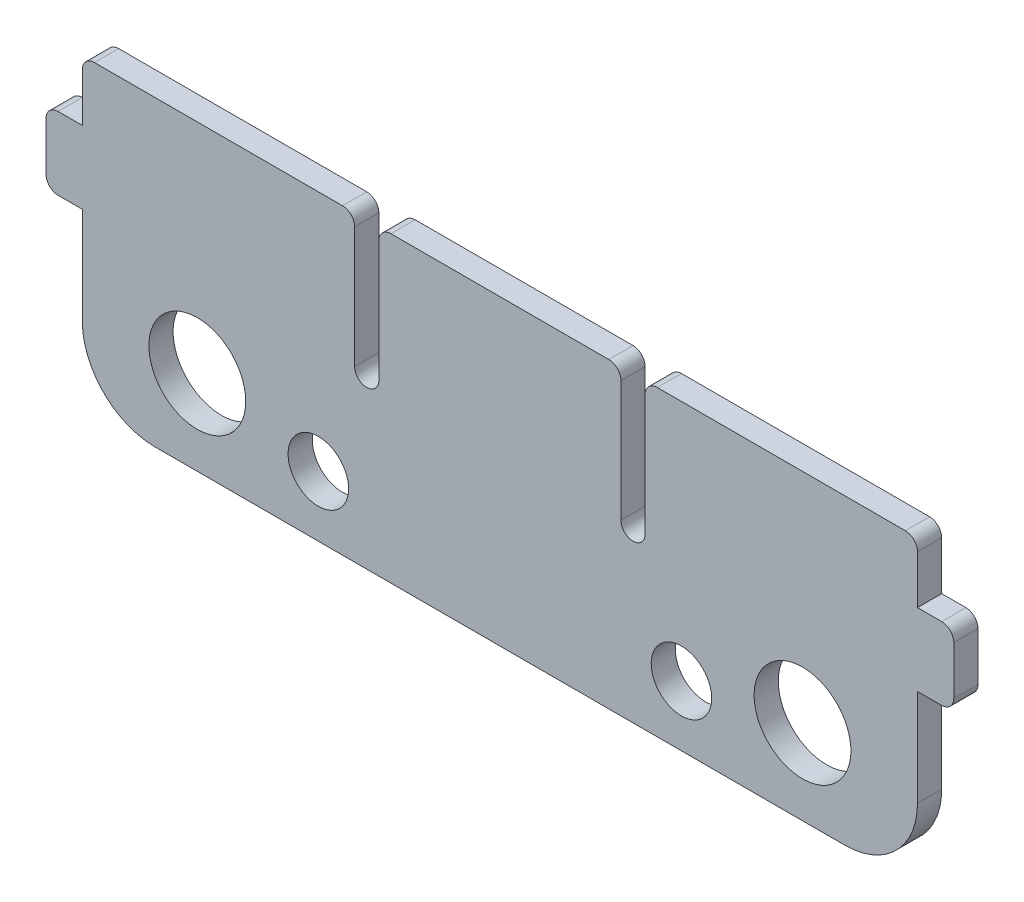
ISO-10303-21;
HEADER;
FILE_DESCRIPTION(('STEP AP214'),'2;1');
FILE_NAME('part.step','',(''),(''),'','','');
FILE_SCHEMA(('AUTOMOTIVE_DESIGN { 1 0 10303 214 1 1 1 1 }'));
ENDSEC;
DATA;
#1=APPLICATION_CONTEXT('core data for automotive mechanical design processes');
#2=APPLICATION_PROTOCOL_DEFINITION('international standard','automotive_design',2000,#1);
#3=PRODUCT_CONTEXT('',#1,'mechanical');
#4=PRODUCT('Part','Part','',(#3));
#5=PRODUCT_RELATED_PRODUCT_CATEGORY('part','',(#4));
#6=PRODUCT_DEFINITION_FORMATION('','',#4);
#7=PRODUCT_DEFINITION_CONTEXT('part definition',#1,'design');
#8=PRODUCT_DEFINITION('design','',#6,#7);
#9=PRODUCT_DEFINITION_SHAPE('','',#8);
#10=(LENGTH_UNIT() NAMED_UNIT(*) SI_UNIT(.MILLI.,.METRE.));
#11=(NAMED_UNIT(*) PLANE_ANGLE_UNIT() SI_UNIT($,.RADIAN.));
#12=(NAMED_UNIT(*) SI_UNIT($,.STERADIAN.) SOLID_ANGLE_UNIT());
#13=UNCERTAINTY_MEASURE_WITH_UNIT(LENGTH_MEASURE(1.E-05),#10,'distance_accuracy_value','');
#14=(GEOMETRIC_REPRESENTATION_CONTEXT(3) GLOBAL_UNCERTAINTY_ASSIGNED_CONTEXT((#13)) GLOBAL_UNIT_ASSIGNED_CONTEXT((#10,
#11,#12)) REPRESENTATION_CONTEXT('',''));
#15=CARTESIAN_POINT('',(0.,0.,0.));
#16=DIRECTION('',(0.,0.,1.));
#17=DIRECTION('',(1.,0.,0.));
#18=AXIS2_PLACEMENT_3D('',#15,#16,#17);
#19=CARTESIAN_POINT('',(28.5,-6.5,2.));
#20=DIRECTION('',(0.,0.,1.));
#21=DIRECTION('',(1.,0.,0.));
#22=AXIS2_PLACEMENT_3D('',#19,#20,#21);
#23=PLANE('',#22);
#24=CARTESIAN_POINT('',(15.,-7.5,2.));
#25=DIRECTION('',(0.,0.,1.));
#26=DIRECTION('',(-1.,0.,0.));
#27=AXIS2_PLACEMENT_3D('',#24,#25,#26);
#28=CIRCLE('',#27,2.5);
#29=CARTESIAN_POINT('',(12.5,-7.5,2.));
#30=VERTEX_POINT('',#29);
#31=EDGE_CURVE('E551',#30,#30,#28,.T.);
#32=ORIENTED_EDGE('',*,*,#31,.F.);
#33=EDGE_LOOP('',(#32));
#34=FACE_BOUND('',#33,.T.);
#35=CARTESIAN_POINT('',(-25.,-5.5,2.));
#36=DIRECTION('',(0.,0.,1.));
#37=DIRECTION('',(1.,0.,0.));
#38=AXIS2_PLACEMENT_3D('',#35,#36,#37);
#39=CIRCLE('',#38,4.);
#40=CARTESIAN_POINT('',(-21.,-5.5,2.));
#41=VERTEX_POINT('',#40);
#42=EDGE_CURVE('E277',#41,#41,#39,.T.);
#43=ORIENTED_EDGE('',*,*,#42,.F.);
#44=EDGE_LOOP('',(#43));
#45=FACE_BOUND('',#44,.T.);
#46=CARTESIAN_POINT('',(28.5,-6.5,2.));
#47=DIRECTION('',(0.,0.,1.));
#48=DIRECTION('',(1.,0.,0.));
#49=AXIS2_PLACEMENT_3D('',#46,#47,#48);
#50=CIRCLE('',#49,6.);
#51=CARTESIAN_POINT('',(28.5,-12.5,2.));
#52=VERTEX_POINT('',#51);
#53=CARTESIAN_POINT('',(34.5,-6.49999999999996,2.));
#54=VERTEX_POINT('',#53);
#55=EDGE_CURVE('E336',#52,#54,#50,.T.);
#56=ORIENTED_EDGE('',*,*,#55,.T.);
#57=DIRECTION('',(0.,1.,0.));
#58=VECTOR('',#57,1.);
#59=CARTESIAN_POINT('',(34.5,1.5,2.));
#60=LINE('',#59,#58);
#61=CARTESIAN_POINT('',(34.5,1.5,2.));
#62=VERTEX_POINT('',#61);
#63=EDGE_CURVE('E164',#54,#62,#60,.T.);
#64=ORIENTED_EDGE('',*,*,#63,.T.);
#65=DIRECTION('',(1.,0.,0.));
#66=VECTOR('',#65,1.);
#67=CARTESIAN_POINT('',(34.5,1.5,2.));
#68=LINE('',#67,#66);
#69=CARTESIAN_POINT('',(36.5,1.5,2.));
#70=VERTEX_POINT('',#69);
#71=EDGE_CURVE('E423',#62,#70,#68,.T.);
#72=ORIENTED_EDGE('',*,*,#71,.T.);
#73=CARTESIAN_POINT('',(36.5,2.5,2.));
#74=DIRECTION('',(0.,0.,1.));
#75=DIRECTION('',(1.,0.,0.));
#76=AXIS2_PLACEMENT_3D('',#73,#74,#75);
#77=CIRCLE('',#76,1.);
#78=CARTESIAN_POINT('',(37.5,2.50000000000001,2.));
#79=VERTEX_POINT('',#78);
#80=EDGE_CURVE('E442',#70,#79,#77,.T.);
#81=ORIENTED_EDGE('',*,*,#80,.T.);
#82=DIRECTION('',(0.,1.,0.));
#83=VECTOR('',#82,1.);
#84=CARTESIAN_POINT('',(37.5,6.5,2.));
#85=LINE('',#84,#83);
#86=CARTESIAN_POINT('',(37.5,6.5,2.));
#87=VERTEX_POINT('',#86);
#88=EDGE_CURVE('E439',#79,#87,#85,.T.);
#89=ORIENTED_EDGE('',*,*,#88,.T.);
#90=CARTESIAN_POINT('',(36.5,6.5,2.));
#91=DIRECTION('',(0.,0.,1.));
#92=DIRECTION('',(-1.,0.,0.));
#93=AXIS2_PLACEMENT_3D('',#90,#91,#92);
#94=CIRCLE('',#93,1.);
#95=CARTESIAN_POINT('',(36.5,7.5,2.));
#96=VERTEX_POINT('',#95);
#97=EDGE_CURVE('E441',#87,#96,#94,.T.);
#98=ORIENTED_EDGE('',*,*,#97,.T.);
#99=DIRECTION('',(-1.,0.,0.));
#100=VECTOR('',#99,1.);
#101=CARTESIAN_POINT('',(34.5,7.5,2.));
#102=LINE('',#101,#100);
#103=CARTESIAN_POINT('',(34.5,7.5,2.));
#104=VERTEX_POINT('',#103);
#105=EDGE_CURVE('E444',#96,#104,#102,.T.);
#106=ORIENTED_EDGE('',*,*,#105,.T.);
#107=DIRECTION('',(0.,1.,0.));
#108=VECTOR('',#107,1.);
#109=CARTESIAN_POINT('',(34.5,11.5,2.));
#110=LINE('',#109,#108);
#111=CARTESIAN_POINT('',(34.5,11.5,2.));
#112=VERTEX_POINT('',#111);
#113=EDGE_CURVE('E450',#104,#112,#110,.T.);
#114=ORIENTED_EDGE('',*,*,#113,.T.);
#115=CARTESIAN_POINT('',(33.5,11.5,2.));
#116=DIRECTION('',(0.,0.,1.));
#117=DIRECTION('',(-1.,0.,0.));
#118=AXIS2_PLACEMENT_3D('',#115,#116,#117);
#119=CIRCLE('',#118,1.);
#120=CARTESIAN_POINT('',(33.5,12.5,2.));
#121=VERTEX_POINT('',#120);
#122=EDGE_CURVE('E452',#112,#121,#119,.T.);
#123=ORIENTED_EDGE('',*,*,#122,.T.);
#124=DIRECTION('',(-1.,0.,0.));
#125=VECTOR('',#124,1.);
#126=CARTESIAN_POINT('',(13.,12.5,2.));
#127=LINE('',#126,#125);
#128=CARTESIAN_POINT('',(13.,12.5,2.));
#129=VERTEX_POINT('',#128);
#130=EDGE_CURVE('E454',#121,#129,#127,.T.);
#131=ORIENTED_EDGE('',*,*,#130,.T.);
#132=CARTESIAN_POINT('',(13.,11.5,2.));
#133=DIRECTION('',(0.,0.,1.));
#134=DIRECTION('',(-1.,0.,0.));
#135=AXIS2_PLACEMENT_3D('',#132,#133,#134);
#136=CIRCLE('',#135,1.);
#137=CARTESIAN_POINT('',(12.,11.5,2.));
#138=VERTEX_POINT('',#137);
#139=EDGE_CURVE('E456',#129,#138,#136,.T.);
#140=ORIENTED_EDGE('',*,*,#139,.T.);
#141=DIRECTION('',(0.,-1.,0.));
#142=VECTOR('',#141,1.);
#143=CARTESIAN_POINT('',(12.,11.5,2.));
#144=LINE('',#143,#142);
#145=CARTESIAN_POINT('',(12.,1.5,2.));
#146=VERTEX_POINT('',#145);
#147=EDGE_CURVE('E458',#138,#146,#144,.T.);
#148=ORIENTED_EDGE('',*,*,#147,.T.);
#149=CARTESIAN_POINT('',(11.,1.5,2.));
#150=DIRECTION('',(0.,0.,-1.));
#151=DIRECTION('',(1.,0.,0.));
#152=AXIS2_PLACEMENT_3D('',#149,#150,#151);
#153=CIRCLE('',#152,0.999999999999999);
#154=CARTESIAN_POINT('',(10.,1.5,2.));
#155=VERTEX_POINT('',#154);
#156=EDGE_CURVE('E460',#146,#155,#153,.T.);
#157=ORIENTED_EDGE('',*,*,#156,.T.);
#158=DIRECTION('',(0.,1.,0.));
#159=VECTOR('',#158,1.);
#160=CARTESIAN_POINT('',(10.,11.5,2.));
#161=LINE('',#160,#159);
#162=CARTESIAN_POINT('',(10.,11.5,2.));
#163=VERTEX_POINT('',#162);
#164=EDGE_CURVE('E462',#155,#163,#161,.T.);
#165=ORIENTED_EDGE('',*,*,#164,.T.);
#166=CARTESIAN_POINT('',(9.,11.5,2.));
#167=DIRECTION('',(0.,0.,1.));
#168=DIRECTION('',(1.,0.,0.));
#169=AXIS2_PLACEMENT_3D('',#166,#167,#168);
#170=CIRCLE('',#169,1.);
#171=CARTESIAN_POINT('',(8.99999999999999,12.5,2.));
#172=VERTEX_POINT('',#171);
#173=EDGE_CURVE('E464',#163,#172,#170,.T.);
#174=ORIENTED_EDGE('',*,*,#173,.T.);
#175=DIRECTION('',(-1.,0.,0.));
#176=VECTOR('',#175,1.);
#177=CARTESIAN_POINT('',(-8.99999999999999,12.5,2.));
#178=LINE('',#177,#176);
#179=CARTESIAN_POINT('',(-8.99999999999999,12.5,2.));
#180=VERTEX_POINT('',#179);
#181=EDGE_CURVE('E466',#172,#180,#178,.T.);
#182=ORIENTED_EDGE('',*,*,#181,.T.);
#183=CARTESIAN_POINT('',(-9.,11.5,2.));
#184=DIRECTION('',(0.,0.,1.));
#185=DIRECTION('',(-1.,0.,0.));
#186=AXIS2_PLACEMENT_3D('',#183,#184,#185);
#187=CIRCLE('',#186,1.);
#188=CARTESIAN_POINT('',(-10.,11.5,2.));
#189=VERTEX_POINT('',#188);
#190=EDGE_CURVE('E468',#180,#189,#187,.T.);
#191=ORIENTED_EDGE('',*,*,#190,.T.);
#192=DIRECTION('',(0.,-1.,0.));
#193=VECTOR('',#192,1.);
#194=CARTESIAN_POINT('',(-10.,11.5,2.));
#195=LINE('',#194,#193);
#196=CARTESIAN_POINT('',(-10.,1.5,2.));
#197=VERTEX_POINT('',#196);
#198=EDGE_CURVE('E470',#189,#197,#195,.T.);
#199=ORIENTED_EDGE('',*,*,#198,.T.);
#200=CARTESIAN_POINT('',(-11.,1.5,2.));
#201=DIRECTION('',(0.,0.,-1.));
#202=DIRECTION('',(1.,0.,0.));
#203=AXIS2_PLACEMENT_3D('',#200,#201,#202);
#204=CIRCLE('',#203,0.999999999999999);
#205=CARTESIAN_POINT('',(-12.,1.5,2.));
#206=VERTEX_POINT('',#205);
#207=EDGE_CURVE('E472',#197,#206,#204,.T.);
#208=ORIENTED_EDGE('',*,*,#207,.T.);
#209=DIRECTION('',(0.,1.,0.));
#210=VECTOR('',#209,1.);
#211=CARTESIAN_POINT('',(-12.,11.5,2.));
#212=LINE('',#211,#210);
#213=CARTESIAN_POINT('',(-12.,11.5,2.));
#214=VERTEX_POINT('',#213);
#215=EDGE_CURVE('E474',#206,#214,#212,.T.);
#216=ORIENTED_EDGE('',*,*,#215,.T.);
#217=CARTESIAN_POINT('',(-13.,11.5,2.));
#218=DIRECTION('',(0.,0.,1.));
#219=DIRECTION('',(1.,0.,0.));
#220=AXIS2_PLACEMENT_3D('',#217,#218,#219);
#221=CIRCLE('',#220,1.);
#222=CARTESIAN_POINT('',(-13.,12.5,2.));
#223=VERTEX_POINT('',#222);
#224=EDGE_CURVE('E476',#214,#223,#221,.T.);
#225=ORIENTED_EDGE('',*,*,#224,.T.);
#226=DIRECTION('',(-1.,0.,0.));
#227=VECTOR('',#226,1.);
#228=CARTESIAN_POINT('',(-33.5,12.5,2.));
#229=LINE('',#228,#227);
#230=CARTESIAN_POINT('',(-33.5,12.5,2.));
#231=VERTEX_POINT('',#230);
#232=EDGE_CURVE('E478',#223,#231,#229,.T.);
#233=ORIENTED_EDGE('',*,*,#232,.T.);
#234=CARTESIAN_POINT('',(-33.5,11.5,2.));
#235=DIRECTION('',(0.,0.,1.));
#236=DIRECTION('',(1.,0.,0.));
#237=AXIS2_PLACEMENT_3D('',#234,#235,#236);
#238=CIRCLE('',#237,1.);
#239=CARTESIAN_POINT('',(-34.5,11.5,2.));
#240=VERTEX_POINT('',#239);
#241=EDGE_CURVE('E480',#231,#240,#238,.T.);
#242=ORIENTED_EDGE('',*,*,#241,.T.);
#243=DIRECTION('',(0.,-1.,0.));
#244=VECTOR('',#243,1.);
#245=CARTESIAN_POINT('',(-34.5,11.5,2.));
#246=LINE('',#245,#244);
#247=CARTESIAN_POINT('',(-34.5,7.5,2.));
#248=VERTEX_POINT('',#247);
#249=EDGE_CURVE('E482',#240,#248,#246,.T.);
#250=ORIENTED_EDGE('',*,*,#249,.T.);
#251=DIRECTION('',(-1.,0.,0.));
#252=VECTOR('',#251,1.);
#253=CARTESIAN_POINT('',(-34.5,7.5,2.));
#254=LINE('',#253,#252);
#255=CARTESIAN_POINT('',(-36.5,7.5,2.));
#256=VERTEX_POINT('',#255);
#257=EDGE_CURVE('E484',#248,#256,#254,.T.);
#258=ORIENTED_EDGE('',*,*,#257,.T.);
#259=CARTESIAN_POINT('',(-36.5,6.5,2.));
#260=DIRECTION('',(0.,0.,1.));
#261=DIRECTION('',(1.,0.,0.));
#262=AXIS2_PLACEMENT_3D('',#259,#260,#261);
#263=CIRCLE('',#262,1.);
#264=CARTESIAN_POINT('',(-37.5,6.5,2.));
#265=VERTEX_POINT('',#264);
#266=EDGE_CURVE('E486',#256,#265,#263,.T.);
#267=ORIENTED_EDGE('',*,*,#266,.T.);
#268=DIRECTION('',(0.,-1.,0.));
#269=VECTOR('',#268,1.);
#270=CARTESIAN_POINT('',(-37.5,6.5,2.));
#271=LINE('',#270,#269);
#272=CARTESIAN_POINT('',(-37.5,2.50000000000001,2.));
#273=VERTEX_POINT('',#272);
#274=EDGE_CURVE('E488',#265,#273,#271,.T.);
#275=ORIENTED_EDGE('',*,*,#274,.T.);
#276=CARTESIAN_POINT('',(-36.5,2.5,2.));
#277=DIRECTION('',(0.,0.,1.));
#278=DIRECTION('',(-1.,0.,0.));
#279=AXIS2_PLACEMENT_3D('',#276,#277,#278);
#280=CIRCLE('',#279,1.);
#281=CARTESIAN_POINT('',(-36.5,1.5,2.));
#282=VERTEX_POINT('',#281);
#283=EDGE_CURVE('E490',#273,#282,#280,.T.);
#284=ORIENTED_EDGE('',*,*,#283,.T.);
#285=DIRECTION('',(1.,0.,0.));
#286=VECTOR('',#285,1.);
#287=CARTESIAN_POINT('',(-34.5,1.5,2.));
#288=LINE('',#287,#286);
#289=CARTESIAN_POINT('',(-34.5,1.5,2.));
#290=VERTEX_POINT('',#289);
#291=EDGE_CURVE('E255',#282,#290,#288,.T.);
#292=ORIENTED_EDGE('',*,*,#291,.T.);
#293=DIRECTION('',(0.,-1.,0.));
#294=VECTOR('',#293,1.);
#295=CARTESIAN_POINT('',(-34.5,1.5,2.));
#296=LINE('',#295,#294);
#297=CARTESIAN_POINT('',(-34.5,-6.49999999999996,2.));
#298=VERTEX_POINT('',#297);
#299=EDGE_CURVE('E249',#290,#298,#296,.T.);
#300=ORIENTED_EDGE('',*,*,#299,.T.);
#301=CARTESIAN_POINT('',(-28.5,-6.5,2.));
#302=DIRECTION('',(0.,0.,1.));
#303=DIRECTION('',(1.,0.,0.));
#304=AXIS2_PLACEMENT_3D('',#301,#302,#303);
#305=CIRCLE('',#304,6.);
#306=CARTESIAN_POINT('',(-28.5,-12.5,2.));
#307=VERTEX_POINT('',#306);
#308=EDGE_CURVE('E253',#298,#307,#305,.T.);
#309=ORIENTED_EDGE('',*,*,#308,.T.);
#310=DIRECTION('',(1.,0.,0.));
#311=VECTOR('',#310,1.);
#312=CARTESIAN_POINT('',(-28.5,-12.5,2.));
#313=LINE('',#312,#311);
#314=EDGE_CURVE('E49',#307,#52,#313,.T.);
#315=ORIENTED_EDGE('',*,*,#314,.T.);
#316=EDGE_LOOP('',(#56,#64,#72,#81,#89,#98,#106,#114,#123,#131,#140,#148,#157,#165,#174,#182,
#191,#199,#208,#216,#225,#233,#242,#250,#258,#267,#275,#284,#292,#300,#309,#315));
#317=FACE_BOUND('',#316,.T.);
#318=CARTESIAN_POINT('',(-15.,-7.5,2.));
#319=DIRECTION('',(0.,0.,1.));
#320=DIRECTION('',(1.,0.,0.));
#321=AXIS2_PLACEMENT_3D('',#318,#319,#320);
#322=CIRCLE('',#321,2.5);
#323=CARTESIAN_POINT('',(-12.5,-7.5,2.));
#324=VERTEX_POINT('',#323);
#325=EDGE_CURVE('E557',#324,#324,#322,.T.);
#326=ORIENTED_EDGE('',*,*,#325,.F.);
#327=EDGE_LOOP('',(#326));
#328=FACE_BOUND('',#327,.T.);
#329=CARTESIAN_POINT('',(25.,-5.49999999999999,2.));
#330=DIRECTION('',(0.,0.,1.));
#331=DIRECTION('',(-1.,0.,0.));
#332=AXIS2_PLACEMENT_3D('',#329,#330,#331);
#333=CIRCLE('',#332,4.);
#334=CARTESIAN_POINT('',(21.,-5.49999999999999,2.));
#335=VERTEX_POINT('',#334);
#336=EDGE_CURVE('E542',#335,#335,#333,.T.);
#337=ORIENTED_EDGE('',*,*,#336,.F.);
#338=EDGE_LOOP('',(#337));
#339=FACE_BOUND('',#338,.T.);
#340=ADVANCED_FACE('F32',(#34,#45,#317,#328,#339),#23,.T.);
#341=CARTESIAN_POINT('',(28.5,-6.5,0.));
#342=DIRECTION('',(0.,0.,1.));
#343=DIRECTION('',(1.,0.,0.));
#344=AXIS2_PLACEMENT_3D('',#341,#342,#343);
#345=PLANE('',#344);
#346=CARTESIAN_POINT('',(15.,-7.5,0.));
#347=DIRECTION('',(0.,0.,1.));
#348=DIRECTION('',(-1.,0.,0.));
#349=AXIS2_PLACEMENT_3D('',#346,#347,#348);
#350=CIRCLE('',#349,2.5);
#351=CARTESIAN_POINT('',(12.5,-7.5,0.));
#352=VERTEX_POINT('',#351);
#353=EDGE_CURVE('E548',#352,#352,#350,.T.);
#354=ORIENTED_EDGE('',*,*,#353,.T.);
#355=EDGE_LOOP('',(#354));
#356=FACE_BOUND('',#355,.T.);
#357=CARTESIAN_POINT('',(-25.,-5.5,0.));
#358=DIRECTION('',(0.,0.,1.));
#359=DIRECTION('',(1.,0.,0.));
#360=AXIS2_PLACEMENT_3D('',#357,#358,#359);
#361=CIRCLE('',#360,4.);
#362=CARTESIAN_POINT('',(-21.,-5.5,0.));
#363=VERTEX_POINT('',#362);
#364=EDGE_CURVE('E560',#363,#363,#361,.T.);
#365=ORIENTED_EDGE('',*,*,#364,.T.);
#366=EDGE_LOOP('',(#365));
#367=FACE_BOUND('',#366,.T.);
#368=CARTESIAN_POINT('',(28.5,-6.5,0.));
#369=DIRECTION('',(0.,0.,1.));
#370=DIRECTION('',(1.,0.,0.));
#371=AXIS2_PLACEMENT_3D('',#368,#369,#370);
#372=CIRCLE('',#371,6.);
#373=CARTESIAN_POINT('',(28.5,-12.5,0.));
#374=VERTEX_POINT('',#373);
#375=CARTESIAN_POINT('',(34.5,-6.49999999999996,0.));
#376=VERTEX_POINT('',#375);
#377=EDGE_CURVE('E273',#374,#376,#372,.T.);
#378=ORIENTED_EDGE('',*,*,#377,.F.);
#379=DIRECTION('',(1.,0.,0.));
#380=VECTOR('',#379,1.);
#381=CARTESIAN_POINT('',(-28.5,-12.5,0.));
#382=LINE('',#381,#380);
#383=CARTESIAN_POINT('',(-28.5,-12.5,0.));
#384=VERTEX_POINT('',#383);
#385=EDGE_CURVE('E156',#384,#374,#382,.T.);
#386=ORIENTED_EDGE('',*,*,#385,.F.);
#387=CARTESIAN_POINT('',(-28.5,-6.5,0.));
#388=DIRECTION('',(0.,0.,1.));
#389=DIRECTION('',(1.,0.,0.));
#390=AXIS2_PLACEMENT_3D('',#387,#388,#389);
#391=CIRCLE('',#390,6.);
#392=CARTESIAN_POINT('',(-34.5,-6.49999999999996,0.));
#393=VERTEX_POINT('',#392);
#394=EDGE_CURVE('E150',#393,#384,#391,.T.);
#395=ORIENTED_EDGE('',*,*,#394,.F.);
#396=DIRECTION('',(0.,-1.,0.));
#397=VECTOR('',#396,1.);
#398=CARTESIAN_POINT('',(-34.5,1.5,0.));
#399=LINE('',#398,#397);
#400=CARTESIAN_POINT('',(-34.5,1.5,0.));
#401=VERTEX_POINT('',#400);
#402=EDGE_CURVE('E263',#401,#393,#399,.T.);
#403=ORIENTED_EDGE('',*,*,#402,.F.);
#404=DIRECTION('',(1.,0.,0.));
#405=VECTOR('',#404,1.);
#406=CARTESIAN_POINT('',(-34.5,1.5,0.));
#407=LINE('',#406,#405);
#408=CARTESIAN_POINT('',(-36.5,1.5,0.));
#409=VERTEX_POINT('',#408);
#410=EDGE_CURVE('E331',#409,#401,#407,.T.);
#411=ORIENTED_EDGE('',*,*,#410,.F.);
#412=CARTESIAN_POINT('',(-36.5,2.5,0.));
#413=DIRECTION('',(0.,0.,1.));
#414=DIRECTION('',(-1.,0.,0.));
#415=AXIS2_PLACEMENT_3D('',#412,#413,#414);
#416=CIRCLE('',#415,1.);
#417=CARTESIAN_POINT('',(-37.5,2.50000000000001,0.));
#418=VERTEX_POINT('',#417);
#419=EDGE_CURVE('E329',#418,#409,#416,.T.);
#420=ORIENTED_EDGE('',*,*,#419,.F.);
#421=DIRECTION('',(0.,-1.,0.));
#422=VECTOR('',#421,1.);
#423=CARTESIAN_POINT('',(-37.5,6.5,0.));
#424=LINE('',#423,#422);
#425=CARTESIAN_POINT('',(-37.5,6.5,0.));
#426=VERTEX_POINT('',#425);
#427=EDGE_CURVE('E327',#426,#418,#424,.T.);
#428=ORIENTED_EDGE('',*,*,#427,.F.);
#429=CARTESIAN_POINT('',(-36.5,6.5,0.));
#430=DIRECTION('',(0.,0.,1.));
#431=DIRECTION('',(1.,0.,0.));
#432=AXIS2_PLACEMENT_3D('',#429,#430,#431);
#433=CIRCLE('',#432,1.);
#434=CARTESIAN_POINT('',(-36.5,7.5,0.));
#435=VERTEX_POINT('',#434);
#436=EDGE_CURVE('E325',#435,#426,#433,.T.);
#437=ORIENTED_EDGE('',*,*,#436,.F.);
#438=DIRECTION('',(-1.,0.,0.));
#439=VECTOR('',#438,1.);
#440=CARTESIAN_POINT('',(-34.5,7.5,0.));
#441=LINE('',#440,#439);
#442=CARTESIAN_POINT('',(-34.5,7.5,0.));
#443=VERTEX_POINT('',#442);
#444=EDGE_CURVE('E323',#443,#435,#441,.T.);
#445=ORIENTED_EDGE('',*,*,#444,.F.);
#446=DIRECTION('',(0.,-1.,0.));
#447=VECTOR('',#446,1.);
#448=CARTESIAN_POINT('',(-34.5,11.5,0.));
#449=LINE('',#448,#447);
#450=CARTESIAN_POINT('',(-34.5,11.5,0.));
#451=VERTEX_POINT('',#450);
#452=EDGE_CURVE('E321',#451,#443,#449,.T.);
#453=ORIENTED_EDGE('',*,*,#452,.F.);
#454=CARTESIAN_POINT('',(-33.5,11.5,0.));
#455=DIRECTION('',(0.,0.,1.));
#456=DIRECTION('',(1.,0.,0.));
#457=AXIS2_PLACEMENT_3D('',#454,#455,#456);
#458=CIRCLE('',#457,1.);
#459=CARTESIAN_POINT('',(-33.5,12.5,0.));
#460=VERTEX_POINT('',#459);
#461=EDGE_CURVE('E319',#460,#451,#458,.T.);
#462=ORIENTED_EDGE('',*,*,#461,.F.);
#463=DIRECTION('',(-1.,0.,0.));
#464=VECTOR('',#463,1.);
#465=CARTESIAN_POINT('',(-33.5,12.5,0.));
#466=LINE('',#465,#464);
#467=CARTESIAN_POINT('',(-13.,12.5,0.));
#468=VERTEX_POINT('',#467);
#469=EDGE_CURVE('E317',#468,#460,#466,.T.);
#470=ORIENTED_EDGE('',*,*,#469,.F.);
#471=CARTESIAN_POINT('',(-13.,11.5,0.));
#472=DIRECTION('',(0.,0.,1.));
#473=DIRECTION('',(1.,0.,0.));
#474=AXIS2_PLACEMENT_3D('',#471,#472,#473);
#475=CIRCLE('',#474,1.);
#476=CARTESIAN_POINT('',(-12.,11.5,0.));
#477=VERTEX_POINT('',#476);
#478=EDGE_CURVE('E315',#477,#468,#475,.T.);
#479=ORIENTED_EDGE('',*,*,#478,.F.);
#480=DIRECTION('',(0.,1.,0.));
#481=VECTOR('',#480,1.);
#482=CARTESIAN_POINT('',(-12.,11.5,0.));
#483=LINE('',#482,#481);
#484=CARTESIAN_POINT('',(-12.,1.5,0.));
#485=VERTEX_POINT('',#484);
#486=EDGE_CURVE('E313',#485,#477,#483,.T.);
#487=ORIENTED_EDGE('',*,*,#486,.F.);
#488=CARTESIAN_POINT('',(-11.,1.5,0.));
#489=DIRECTION('',(0.,0.,-1.));
#490=DIRECTION('',(1.,0.,0.));
#491=AXIS2_PLACEMENT_3D('',#488,#489,#490);
#492=CIRCLE('',#491,0.999999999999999);
#493=CARTESIAN_POINT('',(-10.,1.5,0.));
#494=VERTEX_POINT('',#493);
#495=EDGE_CURVE('E311',#494,#485,#492,.T.);
#496=ORIENTED_EDGE('',*,*,#495,.F.);
#497=DIRECTION('',(0.,-1.,0.));
#498=VECTOR('',#497,1.);
#499=CARTESIAN_POINT('',(-10.,11.5,0.));
#500=LINE('',#499,#498);
#501=CARTESIAN_POINT('',(-10.,11.5,0.));
#502=VERTEX_POINT('',#501);
#503=EDGE_CURVE('E309',#502,#494,#500,.T.);
#504=ORIENTED_EDGE('',*,*,#503,.F.);
#505=CARTESIAN_POINT('',(-9.,11.5,0.));
#506=DIRECTION('',(0.,0.,1.));
#507=DIRECTION('',(-1.,0.,0.));
#508=AXIS2_PLACEMENT_3D('',#505,#506,#507);
#509=CIRCLE('',#508,1.);
#510=CARTESIAN_POINT('',(-8.99999999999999,12.5,0.));
#511=VERTEX_POINT('',#510);
#512=EDGE_CURVE('E307',#511,#502,#509,.T.);
#513=ORIENTED_EDGE('',*,*,#512,.F.);
#514=DIRECTION('',(-1.,0.,0.));
#515=VECTOR('',#514,1.);
#516=CARTESIAN_POINT('',(-8.99999999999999,12.5,0.));
#517=LINE('',#516,#515);
#518=CARTESIAN_POINT('',(8.99999999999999,12.5,0.));
#519=VERTEX_POINT('',#518);
#520=EDGE_CURVE('E305',#519,#511,#517,.T.);
#521=ORIENTED_EDGE('',*,*,#520,.F.);
#522=CARTESIAN_POINT('',(9.,11.5,0.));
#523=DIRECTION('',(0.,0.,1.));
#524=DIRECTION('',(1.,0.,0.));
#525=AXIS2_PLACEMENT_3D('',#522,#523,#524);
#526=CIRCLE('',#525,1.);
#527=CARTESIAN_POINT('',(10.,11.5,0.));
#528=VERTEX_POINT('',#527);
#529=EDGE_CURVE('E303',#528,#519,#526,.T.);
#530=ORIENTED_EDGE('',*,*,#529,.F.);
#531=DIRECTION('',(0.,1.,0.));
#532=VECTOR('',#531,1.);
#533=CARTESIAN_POINT('',(10.,11.5,0.));
#534=LINE('',#533,#532);
#535=CARTESIAN_POINT('',(10.,1.5,0.));
#536=VERTEX_POINT('',#535);
#537=EDGE_CURVE('E301',#536,#528,#534,.T.);
#538=ORIENTED_EDGE('',*,*,#537,.F.);
#539=CARTESIAN_POINT('',(11.,1.5,0.));
#540=DIRECTION('',(0.,0.,-1.));
#541=DIRECTION('',(1.,0.,0.));
#542=AXIS2_PLACEMENT_3D('',#539,#540,#541);
#543=CIRCLE('',#542,0.999999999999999);
#544=CARTESIAN_POINT('',(12.,1.5,0.));
#545=VERTEX_POINT('',#544);
#546=EDGE_CURVE('E299',#545,#536,#543,.T.);
#547=ORIENTED_EDGE('',*,*,#546,.F.);
#548=DIRECTION('',(0.,-1.,0.));
#549=VECTOR('',#548,1.);
#550=CARTESIAN_POINT('',(12.,11.5,0.));
#551=LINE('',#550,#549);
#552=CARTESIAN_POINT('',(12.,11.5,0.));
#553=VERTEX_POINT('',#552);
#554=EDGE_CURVE('E297',#553,#545,#551,.T.);
#555=ORIENTED_EDGE('',*,*,#554,.F.);
#556=CARTESIAN_POINT('',(13.,11.5,0.));
#557=DIRECTION('',(0.,0.,1.));
#558=DIRECTION('',(-1.,0.,0.));
#559=AXIS2_PLACEMENT_3D('',#556,#557,#558);
#560=CIRCLE('',#559,1.);
#561=CARTESIAN_POINT('',(13.,12.5,0.));
#562=VERTEX_POINT('',#561);
#563=EDGE_CURVE('E295',#562,#553,#560,.T.);
#564=ORIENTED_EDGE('',*,*,#563,.F.);
#565=DIRECTION('',(-1.,0.,0.));
#566=VECTOR('',#565,1.);
#567=CARTESIAN_POINT('',(13.,12.5,0.));
#568=LINE('',#567,#566);
#569=CARTESIAN_POINT('',(33.5,12.5,0.));
#570=VERTEX_POINT('',#569);
#571=EDGE_CURVE('E293',#570,#562,#568,.T.);
#572=ORIENTED_EDGE('',*,*,#571,.F.);
#573=CARTESIAN_POINT('',(33.5,11.5,0.));
#574=DIRECTION('',(0.,0.,1.));
#575=DIRECTION('',(-1.,0.,0.));
#576=AXIS2_PLACEMENT_3D('',#573,#574,#575);
#577=CIRCLE('',#576,1.);
#578=CARTESIAN_POINT('',(34.5,11.5,0.));
#579=VERTEX_POINT('',#578);
#580=EDGE_CURVE('E291',#579,#570,#577,.T.);
#581=ORIENTED_EDGE('',*,*,#580,.F.);
#582=DIRECTION('',(0.,1.,0.));
#583=VECTOR('',#582,1.);
#584=CARTESIAN_POINT('',(34.5,11.5,0.));
#585=LINE('',#584,#583);
#586=CARTESIAN_POINT('',(34.5,7.5,0.));
#587=VERTEX_POINT('',#586);
#588=EDGE_CURVE('E289',#587,#579,#585,.T.);
#589=ORIENTED_EDGE('',*,*,#588,.F.);
#590=DIRECTION('',(-1.,0.,0.));
#591=VECTOR('',#590,1.);
#592=CARTESIAN_POINT('',(34.5,7.5,0.));
#593=LINE('',#592,#591);
#594=CARTESIAN_POINT('',(36.5,7.5,0.));
#595=VERTEX_POINT('',#594);
#596=EDGE_CURVE('E287',#595,#587,#593,.T.);
#597=ORIENTED_EDGE('',*,*,#596,.F.);
#598=CARTESIAN_POINT('',(36.5,6.5,0.));
#599=DIRECTION('',(0.,0.,1.));
#600=DIRECTION('',(-1.,0.,0.));
#601=AXIS2_PLACEMENT_3D('',#598,#599,#600);
#602=CIRCLE('',#601,1.);
#603=CARTESIAN_POINT('',(37.5,6.5,0.));
#604=VERTEX_POINT('',#603);
#605=EDGE_CURVE('E285',#604,#595,#602,.T.);
#606=ORIENTED_EDGE('',*,*,#605,.F.);
#607=DIRECTION('',(0.,1.,0.));
#608=VECTOR('',#607,1.);
#609=CARTESIAN_POINT('',(37.5,6.5,0.));
#610=LINE('',#609,#608);
#611=CARTESIAN_POINT('',(37.5,2.50000000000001,0.));
#612=VERTEX_POINT('',#611);
#613=EDGE_CURVE('E283',#612,#604,#610,.T.);
#614=ORIENTED_EDGE('',*,*,#613,.F.);
#615=CARTESIAN_POINT('',(36.5,2.5,0.));
#616=DIRECTION('',(0.,0.,1.));
#617=DIRECTION('',(1.,0.,0.));
#618=AXIS2_PLACEMENT_3D('',#615,#616,#617);
#619=CIRCLE('',#618,1.);
#620=CARTESIAN_POINT('',(36.5,1.5,0.));
#621=VERTEX_POINT('',#620);
#622=EDGE_CURVE('E281',#621,#612,#619,.T.);
#623=ORIENTED_EDGE('',*,*,#622,.F.);
#624=DIRECTION('',(1.,0.,0.));
#625=VECTOR('',#624,1.);
#626=CARTESIAN_POINT('',(34.5,1.5,0.));
#627=LINE('',#626,#625);
#628=CARTESIAN_POINT('',(34.5,1.5,0.));
#629=VERTEX_POINT('',#628);
#630=EDGE_CURVE('E279',#629,#621,#627,.T.);
#631=ORIENTED_EDGE('',*,*,#630,.F.);
#632=DIRECTION('',(0.,1.,0.));
#633=VECTOR('',#632,1.);
#634=CARTESIAN_POINT('',(34.5,1.5,0.));
#635=LINE('',#634,#633);
#636=EDGE_CURVE('E276',#376,#629,#635,.T.);
#637=ORIENTED_EDGE('',*,*,#636,.F.);
#638=EDGE_LOOP('',(#378,#386,#395,#403,#411,#420,#428,#437,#445,#453,#462,#470,#479,#487,#496,
#504,#513,#521,#530,#538,#547,#555,#564,#572,#581,#589,#597,#606,#614,#623,#631,#637));
#639=FACE_BOUND('',#638,.T.);
#640=CARTESIAN_POINT('',(-15.,-7.5,0.));
#641=DIRECTION('',(0.,0.,1.));
#642=DIRECTION('',(1.,0.,0.));
#643=AXIS2_PLACEMENT_3D('',#640,#641,#642);
#644=CIRCLE('',#643,2.5);
#645=CARTESIAN_POINT('',(-12.5,-7.5,0.));
#646=VERTEX_POINT('',#645);
#647=EDGE_CURVE('E554',#646,#646,#644,.T.);
#648=ORIENTED_EDGE('',*,*,#647,.T.);
#649=EDGE_LOOP('',(#648));
#650=FACE_BOUND('',#649,.T.);
#651=CARTESIAN_POINT('',(25.,-5.49999999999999,0.));
#652=DIRECTION('',(0.,0.,1.));
#653=DIRECTION('',(-1.,0.,0.));
#654=AXIS2_PLACEMENT_3D('',#651,#652,#653);
#655=CIRCLE('',#654,4.);
#656=CARTESIAN_POINT('',(21.,-5.49999999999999,0.));
#657=VERTEX_POINT('',#656);
#658=EDGE_CURVE('E545',#657,#657,#655,.T.);
#659=ORIENTED_EDGE('',*,*,#658,.T.);
#660=EDGE_LOOP('',(#659));
#661=FACE_BOUND('',#660,.T.);
#662=ADVANCED_FACE('F427',(#356,#367,#639,#650,#661),#345,.F.);
#663=CARTESIAN_POINT('',(28.5,-6.5,2.));
#664=DIRECTION('',(0.,0.,-1.));
#665=DIRECTION('',(-1.,0.,0.));
#666=AXIS2_PLACEMENT_3D('',#663,#664,#665);
#667=CYLINDRICAL_SURFACE('',#666,6.);
#668=ORIENTED_EDGE('',*,*,#377,.T.);
#669=DIRECTION('',(0.,0.,-1.));
#670=VECTOR('',#669,1.);
#671=CARTESIAN_POINT('',(34.5,-6.49999999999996,2.));
#672=LINE('',#671,#670);
#673=EDGE_CURVE('E11',#54,#376,#672,.T.);
#674=ORIENTED_EDGE('',*,*,#673,.F.);
#675=ORIENTED_EDGE('',*,*,#55,.F.);
#676=DIRECTION('',(0.,0.,-1.));
#677=VECTOR('',#676,1.);
#678=CARTESIAN_POINT('',(28.5,-12.5,2.));
#679=LINE('',#678,#677);
#680=EDGE_CURVE('E269',#52,#374,#679,.T.);
#681=ORIENTED_EDGE('',*,*,#680,.T.);
#682=EDGE_LOOP('',(#668,#674,#675,#681));
#683=FACE_BOUND('',#682,.T.);
#684=ADVANCED_FACE('F34',(#683),#667,.T.);
#685=CARTESIAN_POINT('',(34.5,1.5,2.));
#686=DIRECTION('',(-1.,0.,0.));
#687=DIRECTION('',(0.,0.,1.));
#688=AXIS2_PLACEMENT_3D('',#685,#686,#687);
#689=PLANE('',#688);
#690=ORIENTED_EDGE('',*,*,#636,.T.);
#691=DIRECTION('',(0.,0.,-1.));
#692=VECTOR('',#691,1.);
#693=CARTESIAN_POINT('',(34.5,1.5,2.));
#694=LINE('',#693,#692);
#695=EDGE_CURVE('E41',#62,#629,#694,.T.);
#696=ORIENTED_EDGE('',*,*,#695,.F.);
#697=ORIENTED_EDGE('',*,*,#63,.F.);
#698=ORIENTED_EDGE('',*,*,#673,.T.);
#699=EDGE_LOOP('',(#690,#696,#697,#698));
#700=FACE_BOUND('',#699,.T.);
#701=ADVANCED_FACE('F869',(#700),#689,.F.);
#702=CARTESIAN_POINT('',(34.5,1.5,2.));
#703=DIRECTION('',(0.,1.,0.));
#704=DIRECTION('',(-1.,0.,0.));
#705=AXIS2_PLACEMENT_3D('',#702,#703,#704);
#706=PLANE('',#705);
#707=ORIENTED_EDGE('',*,*,#630,.T.);
#708=DIRECTION('',(0.,0.,-1.));
#709=VECTOR('',#708,1.);
#710=CARTESIAN_POINT('',(36.5,1.5,2.));
#711=LINE('',#710,#709);
#712=EDGE_CURVE('E415',#70,#621,#711,.T.);
#713=ORIENTED_EDGE('',*,*,#712,.F.);
#714=ORIENTED_EDGE('',*,*,#71,.F.);
#715=ORIENTED_EDGE('',*,*,#695,.T.);
#716=EDGE_LOOP('',(#707,#713,#714,#715));
#717=FACE_BOUND('',#716,.T.);
#718=ADVANCED_FACE('F421',(#717),#706,.F.);
#719=CARTESIAN_POINT('',(36.5,2.5,2.));
#720=DIRECTION('',(0.,0.,-1.));
#721=DIRECTION('',(-1.,0.,0.));
#722=AXIS2_PLACEMENT_3D('',#719,#720,#721);
#723=CYLINDRICAL_SURFACE('',#722,1.);
#724=ORIENTED_EDGE('',*,*,#622,.T.);
#725=DIRECTION('',(0.,0.,-1.));
#726=VECTOR('',#725,1.);
#727=CARTESIAN_POINT('',(37.5,2.50000000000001,2.));
#728=LINE('',#727,#726);
#729=EDGE_CURVE('E412',#79,#612,#728,.T.);
#730=ORIENTED_EDGE('',*,*,#729,.F.);
#731=ORIENTED_EDGE('',*,*,#80,.F.);
#732=ORIENTED_EDGE('',*,*,#712,.T.);
#733=EDGE_LOOP('',(#724,#730,#731,#732));
#734=FACE_BOUND('',#733,.T.);
#735=ADVANCED_FACE('F433',(#734),#723,.T.);
#736=CARTESIAN_POINT('',(37.5,6.5,2.));
#737=DIRECTION('',(-1.,0.,0.));
#738=DIRECTION('',(0.,0.,1.));
#739=AXIS2_PLACEMENT_3D('',#736,#737,#738);
#740=PLANE('',#739);
#741=ORIENTED_EDGE('',*,*,#613,.T.);
#742=DIRECTION('',(0.,0.,-1.));
#743=VECTOR('',#742,1.);
#744=CARTESIAN_POINT('',(37.5,6.5,2.));
#745=LINE('',#744,#743);
#746=EDGE_CURVE('E409',#87,#604,#745,.T.);
#747=ORIENTED_EDGE('',*,*,#746,.F.);
#748=ORIENTED_EDGE('',*,*,#88,.F.);
#749=ORIENTED_EDGE('',*,*,#729,.T.);
#750=EDGE_LOOP('',(#741,#747,#748,#749));
#751=FACE_BOUND('',#750,.T.);
#752=ADVANCED_FACE('F437',(#751),#740,.F.);
#753=CARTESIAN_POINT('',(36.5,6.5,2.));
#754=DIRECTION('',(0.,0.,-1.));
#755=DIRECTION('',(-1.,0.,0.));
#756=AXIS2_PLACEMENT_3D('',#753,#754,#755);
#757=CYLINDRICAL_SURFACE('',#756,1.);
#758=ORIENTED_EDGE('',*,*,#605,.T.);
#759=DIRECTION('',(0.,0.,-1.));
#760=VECTOR('',#759,1.);
#761=CARTESIAN_POINT('',(36.5,7.5,2.));
#762=LINE('',#761,#760);
#763=EDGE_CURVE('E406',#96,#595,#762,.T.);
#764=ORIENTED_EDGE('',*,*,#763,.F.);
#765=ORIENTED_EDGE('',*,*,#97,.F.);
#766=ORIENTED_EDGE('',*,*,#746,.T.);
#767=EDGE_LOOP('',(#758,#764,#765,#766));
#768=FACE_BOUND('',#767,.T.);
#769=ADVANCED_FACE('F834',(#768),#757,.T.);
#770=CARTESIAN_POINT('',(34.5,7.5,2.));
#771=DIRECTION('',(0.,-1.,0.));
#772=DIRECTION('',(0.,0.,-1.));
#773=AXIS2_PLACEMENT_3D('',#770,#771,#772);
#774=PLANE('',#773);
#775=ORIENTED_EDGE('',*,*,#596,.T.);
#776=DIRECTION('',(0.,0.,-1.));
#777=VECTOR('',#776,1.);
#778=CARTESIAN_POINT('',(34.5,7.5,2.));
#779=LINE('',#778,#777);
#780=EDGE_CURVE('E403',#104,#587,#779,.T.);
#781=ORIENTED_EDGE('',*,*,#780,.F.);
#782=ORIENTED_EDGE('',*,*,#105,.F.);
#783=ORIENTED_EDGE('',*,*,#763,.T.);
#784=EDGE_LOOP('',(#775,#781,#782,#783));
#785=FACE_BOUND('',#784,.T.);
#786=ADVANCED_FACE('F824',(#785),#774,.F.);
#787=CARTESIAN_POINT('',(34.5,11.5,2.));
#788=DIRECTION('',(-1.,0.,0.));
#789=DIRECTION('',(0.,0.,1.));
#790=AXIS2_PLACEMENT_3D('',#787,#788,#789);
#791=PLANE('',#790);
#792=ORIENTED_EDGE('',*,*,#588,.T.);
#793=DIRECTION('',(0.,0.,-1.));
#794=VECTOR('',#793,1.);
#795=CARTESIAN_POINT('',(34.5,11.5,2.));
#796=LINE('',#795,#794);
#797=EDGE_CURVE('E400',#112,#579,#796,.T.);
#798=ORIENTED_EDGE('',*,*,#797,.F.);
#799=ORIENTED_EDGE('',*,*,#113,.F.);
#800=ORIENTED_EDGE('',*,*,#780,.T.);
#801=EDGE_LOOP('',(#792,#798,#799,#800));
#802=FACE_BOUND('',#801,.T.);
#803=ADVANCED_FACE('F814',(#802),#791,.F.);
#804=CARTESIAN_POINT('',(33.5,11.5,2.));
#805=DIRECTION('',(0.,0.,-1.));
#806=DIRECTION('',(-1.,0.,0.));
#807=AXIS2_PLACEMENT_3D('',#804,#805,#806);
#808=CYLINDRICAL_SURFACE('',#807,1.);
#809=ORIENTED_EDGE('',*,*,#580,.T.);
#810=DIRECTION('',(0.,0.,-1.));
#811=VECTOR('',#810,1.);
#812=CARTESIAN_POINT('',(33.5,12.5,2.));
#813=LINE('',#812,#811);
#814=EDGE_CURVE('E397',#121,#570,#813,.T.);
#815=ORIENTED_EDGE('',*,*,#814,.F.);
#816=ORIENTED_EDGE('',*,*,#122,.F.);
#817=ORIENTED_EDGE('',*,*,#797,.T.);
#818=EDGE_LOOP('',(#809,#815,#816,#817));
#819=FACE_BOUND('',#818,.T.);
#820=ADVANCED_FACE('F804',(#819),#808,.T.);
#821=CARTESIAN_POINT('',(13.,12.5,2.));
#822=DIRECTION('',(0.,-1.,0.));
#823=DIRECTION('',(0.,0.,-1.));
#824=AXIS2_PLACEMENT_3D('',#821,#822,#823);
#825=PLANE('',#824);
#826=ORIENTED_EDGE('',*,*,#571,.T.);
#827=DIRECTION('',(0.,0.,-1.));
#828=VECTOR('',#827,1.);
#829=CARTESIAN_POINT('',(13.,12.5,2.));
#830=LINE('',#829,#828);
#831=EDGE_CURVE('E394',#129,#562,#830,.T.);
#832=ORIENTED_EDGE('',*,*,#831,.F.);
#833=ORIENTED_EDGE('',*,*,#130,.F.);
#834=ORIENTED_EDGE('',*,*,#814,.T.);
#835=EDGE_LOOP('',(#826,#832,#833,#834));
#836=FACE_BOUND('',#835,.T.);
#837=ADVANCED_FACE('F794',(#836),#825,.F.);
#838=CARTESIAN_POINT('',(13.,11.5,2.));
#839=DIRECTION('',(0.,0.,-1.));
#840=DIRECTION('',(-1.,0.,0.));
#841=AXIS2_PLACEMENT_3D('',#838,#839,#840);
#842=CYLINDRICAL_SURFACE('',#841,1.);
#843=ORIENTED_EDGE('',*,*,#563,.T.);
#844=DIRECTION('',(0.,0.,-1.));
#845=VECTOR('',#844,1.);
#846=CARTESIAN_POINT('',(12.,11.5,2.));
#847=LINE('',#846,#845);
#848=EDGE_CURVE('E391',#138,#553,#847,.T.);
#849=ORIENTED_EDGE('',*,*,#848,.F.);
#850=ORIENTED_EDGE('',*,*,#139,.F.);
#851=ORIENTED_EDGE('',*,*,#831,.T.);
#852=EDGE_LOOP('',(#843,#849,#850,#851));
#853=FACE_BOUND('',#852,.T.);
#854=ADVANCED_FACE('F784',(#853),#842,.T.);
#855=CARTESIAN_POINT('',(12.,11.5,2.));
#856=DIRECTION('',(1.,0.,0.));
#857=DIRECTION('',(0.,1.,0.));
#858=AXIS2_PLACEMENT_3D('',#855,#856,#857);
#859=PLANE('',#858);
#860=ORIENTED_EDGE('',*,*,#554,.T.);
#861=DIRECTION('',(0.,0.,-1.));
#862=VECTOR('',#861,1.);
#863=CARTESIAN_POINT('',(12.,1.5,2.));
#864=LINE('',#863,#862);
#865=EDGE_CURVE('E388',#146,#545,#864,.T.);
#866=ORIENTED_EDGE('',*,*,#865,.F.);
#867=ORIENTED_EDGE('',*,*,#147,.F.);
#868=ORIENTED_EDGE('',*,*,#848,.T.);
#869=EDGE_LOOP('',(#860,#866,#867,#868));
#870=FACE_BOUND('',#869,.T.);
#871=ADVANCED_FACE('F774',(#870),#859,.F.);
#872=CARTESIAN_POINT('',(11.,1.5,2.));
#873=DIRECTION('',(0.,0.,-1.));
#874=DIRECTION('',(-1.,0.,0.));
#875=AXIS2_PLACEMENT_3D('',#872,#873,#874);
#876=CYLINDRICAL_SURFACE('',#875,0.999999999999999);
#877=ORIENTED_EDGE('',*,*,#546,.T.);
#878=DIRECTION('',(0.,0.,-1.));
#879=VECTOR('',#878,1.);
#880=CARTESIAN_POINT('',(10.,1.5,2.));
#881=LINE('',#880,#879);
#882=EDGE_CURVE('E385',#155,#536,#881,.T.);
#883=ORIENTED_EDGE('',*,*,#882,.F.);
#884=ORIENTED_EDGE('',*,*,#156,.F.);
#885=ORIENTED_EDGE('',*,*,#865,.T.);
#886=EDGE_LOOP('',(#877,#883,#884,#885));
#887=FACE_BOUND('',#886,.T.);
#888=ADVANCED_FACE('F764',(#887),#876,.F.);
#889=CARTESIAN_POINT('',(10.,11.5,2.));
#890=DIRECTION('',(-1.,0.,0.));
#891=DIRECTION('',(0.,-1.,0.));
#892=AXIS2_PLACEMENT_3D('',#889,#890,#891);
#893=PLANE('',#892);
#894=ORIENTED_EDGE('',*,*,#537,.T.);
#895=DIRECTION('',(0.,0.,-1.));
#896=VECTOR('',#895,1.);
#897=CARTESIAN_POINT('',(10.,11.5,2.));
#898=LINE('',#897,#896);
#899=EDGE_CURVE('E382',#163,#528,#898,.T.);
#900=ORIENTED_EDGE('',*,*,#899,.F.);
#901=ORIENTED_EDGE('',*,*,#164,.F.);
#902=ORIENTED_EDGE('',*,*,#882,.T.);
#903=EDGE_LOOP('',(#894,#900,#901,#902));
#904=FACE_BOUND('',#903,.T.);
#905=ADVANCED_FACE('F754',(#904),#893,.F.);
#906=CARTESIAN_POINT('',(9.,11.5,2.));
#907=DIRECTION('',(0.,0.,-1.));
#908=DIRECTION('',(-1.,0.,0.));
#909=AXIS2_PLACEMENT_3D('',#906,#907,#908);
#910=CYLINDRICAL_SURFACE('',#909,1.);
#911=ORIENTED_EDGE('',*,*,#529,.T.);
#912=DIRECTION('',(0.,0.,-1.));
#913=VECTOR('',#912,1.);
#914=CARTESIAN_POINT('',(8.99999999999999,12.5,2.));
#915=LINE('',#914,#913);
#916=EDGE_CURVE('E379',#172,#519,#915,.T.);
#917=ORIENTED_EDGE('',*,*,#916,.F.);
#918=ORIENTED_EDGE('',*,*,#173,.F.);
#919=ORIENTED_EDGE('',*,*,#899,.T.);
#920=EDGE_LOOP('',(#911,#917,#918,#919));
#921=FACE_BOUND('',#920,.T.);
#922=ADVANCED_FACE('F744',(#921),#910,.T.);
#923=CARTESIAN_POINT('',(-8.99999999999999,12.5,2.));
#924=DIRECTION('',(0.,-1.,0.));
#925=DIRECTION('',(0.,0.,-1.));
#926=AXIS2_PLACEMENT_3D('',#923,#924,#925);
#927=PLANE('',#926);
#928=ORIENTED_EDGE('',*,*,#520,.T.);
#929=DIRECTION('',(0.,0.,-1.));
#930=VECTOR('',#929,1.);
#931=CARTESIAN_POINT('',(-8.99999999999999,12.5,2.));
#932=LINE('',#931,#930);
#933=EDGE_CURVE('E376',#180,#511,#932,.T.);
#934=ORIENTED_EDGE('',*,*,#933,.F.);
#935=ORIENTED_EDGE('',*,*,#181,.F.);
#936=ORIENTED_EDGE('',*,*,#916,.T.);
#937=EDGE_LOOP('',(#928,#934,#935,#936));
#938=FACE_BOUND('',#937,.T.);
#939=ADVANCED_FACE('F734',(#938),#927,.F.);
#940=CARTESIAN_POINT('',(-9.,11.5,2.));
#941=DIRECTION('',(0.,0.,-1.));
#942=DIRECTION('',(-1.,0.,0.));
#943=AXIS2_PLACEMENT_3D('',#940,#941,#942);
#944=CYLINDRICAL_SURFACE('',#943,1.);
#945=ORIENTED_EDGE('',*,*,#512,.T.);
#946=DIRECTION('',(0.,0.,-1.));
#947=VECTOR('',#946,1.);
#948=CARTESIAN_POINT('',(-10.,11.5,2.));
#949=LINE('',#948,#947);
#950=EDGE_CURVE('E373',#189,#502,#949,.T.);
#951=ORIENTED_EDGE('',*,*,#950,.F.);
#952=ORIENTED_EDGE('',*,*,#190,.F.);
#953=ORIENTED_EDGE('',*,*,#933,.T.);
#954=EDGE_LOOP('',(#945,#951,#952,#953));
#955=FACE_BOUND('',#954,.T.);
#956=ADVANCED_FACE('F724',(#955),#944,.T.);
#957=CARTESIAN_POINT('',(-10.,11.5,2.));
#958=DIRECTION('',(1.,0.,0.));
#959=DIRECTION('',(0.,1.,0.));
#960=AXIS2_PLACEMENT_3D('',#957,#958,#959);
#961=PLANE('',#960);
#962=ORIENTED_EDGE('',*,*,#503,.T.);
#963=DIRECTION('',(0.,0.,-1.));
#964=VECTOR('',#963,1.);
#965=CARTESIAN_POINT('',(-10.,1.5,2.));
#966=LINE('',#965,#964);
#967=EDGE_CURVE('E370',#197,#494,#966,.T.);
#968=ORIENTED_EDGE('',*,*,#967,.F.);
#969=ORIENTED_EDGE('',*,*,#198,.F.);
#970=ORIENTED_EDGE('',*,*,#950,.T.);
#971=EDGE_LOOP('',(#962,#968,#969,#970));
#972=FACE_BOUND('',#971,.T.);
#973=ADVANCED_FACE('F714',(#972),#961,.F.);
#974=CARTESIAN_POINT('',(-11.,1.5,2.));
#975=DIRECTION('',(0.,0.,-1.));
#976=DIRECTION('',(-1.,0.,0.));
#977=AXIS2_PLACEMENT_3D('',#974,#975,#976);
#978=CYLINDRICAL_SURFACE('',#977,0.999999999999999);
#979=ORIENTED_EDGE('',*,*,#495,.T.);
#980=DIRECTION('',(0.,0.,-1.));
#981=VECTOR('',#980,1.);
#982=CARTESIAN_POINT('',(-12.,1.5,2.));
#983=LINE('',#982,#981);
#984=EDGE_CURVE('E367',#206,#485,#983,.T.);
#985=ORIENTED_EDGE('',*,*,#984,.F.);
#986=ORIENTED_EDGE('',*,*,#207,.F.);
#987=ORIENTED_EDGE('',*,*,#967,.T.);
#988=EDGE_LOOP('',(#979,#985,#986,#987));
#989=FACE_BOUND('',#988,.T.);
#990=ADVANCED_FACE('F704',(#989),#978,.F.);
#991=CARTESIAN_POINT('',(-12.,11.5,2.));
#992=DIRECTION('',(-1.,0.,0.));
#993=DIRECTION('',(0.,-1.,0.));
#994=AXIS2_PLACEMENT_3D('',#991,#992,#993);
#995=PLANE('',#994);
#996=ORIENTED_EDGE('',*,*,#486,.T.);
#997=DIRECTION('',(0.,0.,-1.));
#998=VECTOR('',#997,1.);
#999=CARTESIAN_POINT('',(-12.,11.5,2.));
#1000=LINE('',#999,#998);
#1001=EDGE_CURVE('E364',#214,#477,#1000,.T.);
#1002=ORIENTED_EDGE('',*,*,#1001,.F.);
#1003=ORIENTED_EDGE('',*,*,#215,.F.);
#1004=ORIENTED_EDGE('',*,*,#984,.T.);
#1005=EDGE_LOOP('',(#996,#1002,#1003,#1004));
#1006=FACE_BOUND('',#1005,.T.);
#1007=ADVANCED_FACE('F694',(#1006),#995,.F.);
#1008=CARTESIAN_POINT('',(-13.,11.5,2.));
#1009=DIRECTION('',(0.,0.,-1.));
#1010=DIRECTION('',(-1.,0.,0.));
#1011=AXIS2_PLACEMENT_3D('',#1008,#1009,#1010);
#1012=CYLINDRICAL_SURFACE('',#1011,1.);
#1013=ORIENTED_EDGE('',*,*,#478,.T.);
#1014=DIRECTION('',(0.,0.,-1.));
#1015=VECTOR('',#1014,1.);
#1016=CARTESIAN_POINT('',(-13.,12.5,2.));
#1017=LINE('',#1016,#1015);
#1018=EDGE_CURVE('E361',#223,#468,#1017,.T.);
#1019=ORIENTED_EDGE('',*,*,#1018,.F.);
#1020=ORIENTED_EDGE('',*,*,#224,.F.);
#1021=ORIENTED_EDGE('',*,*,#1001,.T.);
#1022=EDGE_LOOP('',(#1013,#1019,#1020,#1021));
#1023=FACE_BOUND('',#1022,.T.);
#1024=ADVANCED_FACE('F684',(#1023),#1012,.T.);
#1025=CARTESIAN_POINT('',(-33.5,12.5,2.));
#1026=DIRECTION('',(0.,-1.,0.));
#1027=DIRECTION('',(0.,0.,-1.));
#1028=AXIS2_PLACEMENT_3D('',#1025,#1026,#1027);
#1029=PLANE('',#1028);
#1030=ORIENTED_EDGE('',*,*,#469,.T.);
#1031=DIRECTION('',(0.,0.,-1.));
#1032=VECTOR('',#1031,1.);
#1033=CARTESIAN_POINT('',(-33.5,12.5,2.));
#1034=LINE('',#1033,#1032);
#1035=EDGE_CURVE('E358',#231,#460,#1034,.T.);
#1036=ORIENTED_EDGE('',*,*,#1035,.F.);
#1037=ORIENTED_EDGE('',*,*,#232,.F.);
#1038=ORIENTED_EDGE('',*,*,#1018,.T.);
#1039=EDGE_LOOP('',(#1030,#1036,#1037,#1038));
#1040=FACE_BOUND('',#1039,.T.);
#1041=ADVANCED_FACE('F674',(#1040),#1029,.F.);
#1042=CARTESIAN_POINT('',(-33.5,11.5,2.));
#1043=DIRECTION('',(0.,0.,-1.));
#1044=DIRECTION('',(-1.,0.,0.));
#1045=AXIS2_PLACEMENT_3D('',#1042,#1043,#1044);
#1046=CYLINDRICAL_SURFACE('',#1045,1.);
#1047=ORIENTED_EDGE('',*,*,#461,.T.);
#1048=DIRECTION('',(0.,0.,-1.));
#1049=VECTOR('',#1048,1.);
#1050=CARTESIAN_POINT('',(-34.5,11.5,2.));
#1051=LINE('',#1050,#1049);
#1052=EDGE_CURVE('E355',#240,#451,#1051,.T.);
#1053=ORIENTED_EDGE('',*,*,#1052,.F.);
#1054=ORIENTED_EDGE('',*,*,#241,.F.);
#1055=ORIENTED_EDGE('',*,*,#1035,.T.);
#1056=EDGE_LOOP('',(#1047,#1053,#1054,#1055));
#1057=FACE_BOUND('',#1056,.T.);
#1058=ADVANCED_FACE('F664',(#1057),#1046,.T.);
#1059=CARTESIAN_POINT('',(-34.5,11.5,2.));
#1060=DIRECTION('',(1.,0.,0.));
#1061=DIRECTION('',(0.,0.,-1.));
#1062=AXIS2_PLACEMENT_3D('',#1059,#1060,#1061);
#1063=PLANE('',#1062);
#1064=ORIENTED_EDGE('',*,*,#452,.T.);
#1065=DIRECTION('',(0.,0.,-1.));
#1066=VECTOR('',#1065,1.);
#1067=CARTESIAN_POINT('',(-34.5,7.5,2.));
#1068=LINE('',#1067,#1066);
#1069=EDGE_CURVE('E352',#248,#443,#1068,.T.);
#1070=ORIENTED_EDGE('',*,*,#1069,.F.);
#1071=ORIENTED_EDGE('',*,*,#249,.F.);
#1072=ORIENTED_EDGE('',*,*,#1052,.T.);
#1073=EDGE_LOOP('',(#1064,#1070,#1071,#1072));
#1074=FACE_BOUND('',#1073,.T.);
#1075=ADVANCED_FACE('F654',(#1074),#1063,.F.);
#1076=CARTESIAN_POINT('',(-34.5,7.5,2.));
#1077=DIRECTION('',(0.,-1.,0.));
#1078=DIRECTION('',(0.,0.,-1.));
#1079=AXIS2_PLACEMENT_3D('',#1076,#1077,#1078);
#1080=PLANE('',#1079);
#1081=ORIENTED_EDGE('',*,*,#444,.T.);
#1082=DIRECTION('',(0.,0.,-1.));
#1083=VECTOR('',#1082,1.);
#1084=CARTESIAN_POINT('',(-36.5,7.5,2.));
#1085=LINE('',#1084,#1083);
#1086=EDGE_CURVE('E349',#256,#435,#1085,.T.);
#1087=ORIENTED_EDGE('',*,*,#1086,.F.);
#1088=ORIENTED_EDGE('',*,*,#257,.F.);
#1089=ORIENTED_EDGE('',*,*,#1069,.T.);
#1090=EDGE_LOOP('',(#1081,#1087,#1088,#1089));
#1091=FACE_BOUND('',#1090,.T.);
#1092=ADVANCED_FACE('F644',(#1091),#1080,.F.);
#1093=CARTESIAN_POINT('',(-36.5,6.5,2.));
#1094=DIRECTION('',(0.,0.,-1.));
#1095=DIRECTION('',(-1.,0.,0.));
#1096=AXIS2_PLACEMENT_3D('',#1093,#1094,#1095);
#1097=CYLINDRICAL_SURFACE('',#1096,1.);
#1098=ORIENTED_EDGE('',*,*,#436,.T.);
#1099=DIRECTION('',(0.,0.,-1.));
#1100=VECTOR('',#1099,1.);
#1101=CARTESIAN_POINT('',(-37.5,6.5,2.));
#1102=LINE('',#1101,#1100);
#1103=EDGE_CURVE('E346',#265,#426,#1102,.T.);
#1104=ORIENTED_EDGE('',*,*,#1103,.F.);
#1105=ORIENTED_EDGE('',*,*,#266,.F.);
#1106=ORIENTED_EDGE('',*,*,#1086,.T.);
#1107=EDGE_LOOP('',(#1098,#1104,#1105,#1106));
#1108=FACE_BOUND('',#1107,.T.);
#1109=ADVANCED_FACE('F634',(#1108),#1097,.T.);
#1110=CARTESIAN_POINT('',(-37.5,6.5,2.));
#1111=DIRECTION('',(1.,0.,0.));
#1112=DIRECTION('',(0.,0.,-1.));
#1113=AXIS2_PLACEMENT_3D('',#1110,#1111,#1112);
#1114=PLANE('',#1113);
#1115=ORIENTED_EDGE('',*,*,#427,.T.);
#1116=DIRECTION('',(0.,0.,-1.));
#1117=VECTOR('',#1116,1.);
#1118=CARTESIAN_POINT('',(-37.5,2.50000000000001,2.));
#1119=LINE('',#1118,#1117);
#1120=EDGE_CURVE('E343',#273,#418,#1119,.T.);
#1121=ORIENTED_EDGE('',*,*,#1120,.F.);
#1122=ORIENTED_EDGE('',*,*,#274,.F.);
#1123=ORIENTED_EDGE('',*,*,#1103,.T.);
#1124=EDGE_LOOP('',(#1115,#1121,#1122,#1123));
#1125=FACE_BOUND('',#1124,.T.);
#1126=ADVANCED_FACE('F625',(#1125),#1114,.F.);
#1127=CARTESIAN_POINT('',(-36.5,2.5,2.));
#1128=DIRECTION('',(0.,0.,-1.));
#1129=DIRECTION('',(-1.,0.,0.));
#1130=AXIS2_PLACEMENT_3D('',#1127,#1128,#1129);
#1131=CYLINDRICAL_SURFACE('',#1130,1.);
#1132=ORIENTED_EDGE('',*,*,#419,.T.);
#1133=DIRECTION('',(0.,0.,-1.));
#1134=VECTOR('',#1133,1.);
#1135=CARTESIAN_POINT('',(-36.5,1.5,2.));
#1136=LINE('',#1135,#1134);
#1137=EDGE_CURVE('E340',#282,#409,#1136,.T.);
#1138=ORIENTED_EDGE('',*,*,#1137,.F.);
#1139=ORIENTED_EDGE('',*,*,#283,.F.);
#1140=ORIENTED_EDGE('',*,*,#1120,.T.);
#1141=EDGE_LOOP('',(#1132,#1138,#1139,#1140));
#1142=FACE_BOUND('',#1141,.T.);
#1143=ADVANCED_FACE('F496',(#1142),#1131,.T.);
#1144=CARTESIAN_POINT('',(-34.5,1.5,2.));
#1145=DIRECTION('',(0.,1.,0.));
#1146=DIRECTION('',(0.,0.,1.));
#1147=AXIS2_PLACEMENT_3D('',#1144,#1145,#1146);
#1148=PLANE('',#1147);
#1149=ORIENTED_EDGE('',*,*,#410,.T.);
#1150=DIRECTION('',(0.,0.,-1.));
#1151=VECTOR('',#1150,1.);
#1152=CARTESIAN_POINT('',(-34.5,1.5,2.));
#1153=LINE('',#1152,#1151);
#1154=EDGE_CURVE('E264',#290,#401,#1153,.T.);
#1155=ORIENTED_EDGE('',*,*,#1154,.F.);
#1156=ORIENTED_EDGE('',*,*,#291,.F.);
#1157=ORIENTED_EDGE('',*,*,#1137,.T.);
#1158=EDGE_LOOP('',(#1149,#1155,#1156,#1157));
#1159=FACE_BOUND('',#1158,.T.);
#1160=ADVANCED_FACE('F500',(#1159),#1148,.F.);
#1161=CARTESIAN_POINT('',(-34.5,1.5,2.));
#1162=DIRECTION('',(1.,0.,0.));
#1163=DIRECTION('',(0.,0.,-1.));
#1164=AXIS2_PLACEMENT_3D('',#1161,#1162,#1163);
#1165=PLANE('',#1164);
#1166=ORIENTED_EDGE('',*,*,#402,.T.);
#1167=DIRECTION('',(0.,0.,-1.));
#1168=VECTOR('',#1167,1.);
#1169=CARTESIAN_POINT('',(-34.5,-6.49999999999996,2.));
#1170=LINE('',#1169,#1168);
#1171=EDGE_CURVE('E260',#298,#393,#1170,.T.);
#1172=ORIENTED_EDGE('',*,*,#1171,.F.);
#1173=ORIENTED_EDGE('',*,*,#299,.F.);
#1174=ORIENTED_EDGE('',*,*,#1154,.T.);
#1175=EDGE_LOOP('',(#1166,#1172,#1173,#1174));
#1176=FACE_BOUND('',#1175,.T.);
#1177=ADVANCED_FACE('F261',(#1176),#1165,.F.);
#1178=CARTESIAN_POINT('',(-28.5,-6.5,2.));
#1179=DIRECTION('',(0.,0.,-1.));
#1180=DIRECTION('',(-1.,0.,0.));
#1181=AXIS2_PLACEMENT_3D('',#1178,#1179,#1180);
#1182=CYLINDRICAL_SURFACE('',#1181,6.);
#1183=ORIENTED_EDGE('',*,*,#394,.T.);
#1184=DIRECTION('',(0.,0.,-1.));
#1185=VECTOR('',#1184,1.);
#1186=CARTESIAN_POINT('',(-28.5,-12.5,2.));
#1187=LINE('',#1186,#1185);
#1188=EDGE_CURVE('E265',#307,#384,#1187,.T.);
#1189=ORIENTED_EDGE('',*,*,#1188,.F.);
#1190=ORIENTED_EDGE('',*,*,#308,.F.);
#1191=ORIENTED_EDGE('',*,*,#1171,.T.);
#1192=EDGE_LOOP('',(#1183,#1189,#1190,#1191));
#1193=FACE_BOUND('',#1192,.T.);
#1194=ADVANCED_FACE('F267',(#1193),#1182,.T.);
#1195=CARTESIAN_POINT('',(-28.5,-12.5,2.));
#1196=DIRECTION('',(0.,1.,0.));
#1197=DIRECTION('',(0.,0.,1.));
#1198=AXIS2_PLACEMENT_3D('',#1195,#1196,#1197);
#1199=PLANE('',#1198);
#1200=ORIENTED_EDGE('',*,*,#385,.T.);
#1201=ORIENTED_EDGE('',*,*,#680,.F.);
#1202=ORIENTED_EDGE('',*,*,#314,.F.);
#1203=ORIENTED_EDGE('',*,*,#1188,.T.);
#1204=EDGE_LOOP('',(#1200,#1201,#1202,#1203));
#1205=FACE_BOUND('',#1204,.T.);
#1206=ADVANCED_FACE('F504',(#1205),#1199,.F.);
#1207=CARTESIAN_POINT('',(-25.,-5.5,2.));
#1208=DIRECTION('',(0.,0.,-1.));
#1209=DIRECTION('',(-1.,0.,0.));
#1210=AXIS2_PLACEMENT_3D('',#1207,#1208,#1209);
#1211=CYLINDRICAL_SURFACE('',#1210,4.);
#1212=ORIENTED_EDGE('',*,*,#42,.T.);
#1213=EDGE_LOOP('',(#1212));
#1214=FACE_BOUND('',#1213,.T.);
#1215=ORIENTED_EDGE('',*,*,#364,.F.);
#1216=EDGE_LOOP('',(#1215));
#1217=FACE_BOUND('',#1216,.T.);
#1218=ADVANCED_FACE('F506',(#1214,#1217),#1211,.F.);
#1219=CARTESIAN_POINT('',(-15.,-7.5,2.));
#1220=DIRECTION('',(0.,0.,-1.));
#1221=DIRECTION('',(-1.,0.,0.));
#1222=AXIS2_PLACEMENT_3D('',#1219,#1220,#1221);
#1223=CYLINDRICAL_SURFACE('',#1222,2.5);
#1224=ORIENTED_EDGE('',*,*,#325,.T.);
#1225=EDGE_LOOP('',(#1224));
#1226=FACE_BOUND('',#1225,.T.);
#1227=ORIENTED_EDGE('',*,*,#647,.F.);
#1228=EDGE_LOOP('',(#1227));
#1229=FACE_BOUND('',#1228,.T.);
#1230=ADVANCED_FACE('F512',(#1226,#1229),#1223,.F.);
#1231=CARTESIAN_POINT('',(15.,-7.5,2.));
#1232=DIRECTION('',(0.,0.,-1.));
#1233=DIRECTION('',(-1.,0.,0.));
#1234=AXIS2_PLACEMENT_3D('',#1231,#1232,#1233);
#1235=CYLINDRICAL_SURFACE('',#1234,2.5);
#1236=ORIENTED_EDGE('',*,*,#31,.T.);
#1237=EDGE_LOOP('',(#1236));
#1238=FACE_BOUND('',#1237,.T.);
#1239=ORIENTED_EDGE('',*,*,#353,.F.);
#1240=EDGE_LOOP('',(#1239));
#1241=FACE_BOUND('',#1240,.T.);
#1242=ADVANCED_FACE('F529',(#1238,#1241),#1235,.F.);
#1243=CARTESIAN_POINT('',(25.,-5.49999999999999,2.));
#1244=DIRECTION('',(0.,0.,-1.));
#1245=DIRECTION('',(-1.,0.,0.));
#1246=AXIS2_PLACEMENT_3D('',#1243,#1244,#1245);
#1247=CYLINDRICAL_SURFACE('',#1246,4.);
#1248=ORIENTED_EDGE('',*,*,#336,.T.);
#1249=EDGE_LOOP('',(#1248));
#1250=FACE_BOUND('',#1249,.T.);
#1251=ORIENTED_EDGE('',*,*,#658,.F.);
#1252=EDGE_LOOP('',(#1251));
#1253=FACE_BOUND('',#1252,.T.);
#1254=ADVANCED_FACE('F533',(#1250,#1253),#1247,.F.);
#1255=CLOSED_SHELL('',(#340,#662,#684,#701,#718,#735,#752,#769,#786,#803,#820,#837,#854,#871,
#888,#905,#922,#939,#956,#973,#990,#1007,#1024,#1041,#1058,#1075,#1092,#1109,#1126,#1143,#1160,
#1177,#1194,#1206,#1218,#1230,#1242,#1254));
#1256=MANIFOLD_SOLID_BREP('B2',#1255);
#1257=ADVANCED_BREP_SHAPE_REPRESENTATION('',(#18,#1256),#14);
#1258=SHAPE_DEFINITION_REPRESENTATION(#9,#1257);
ENDSEC;
END-ISO-10303-21;
